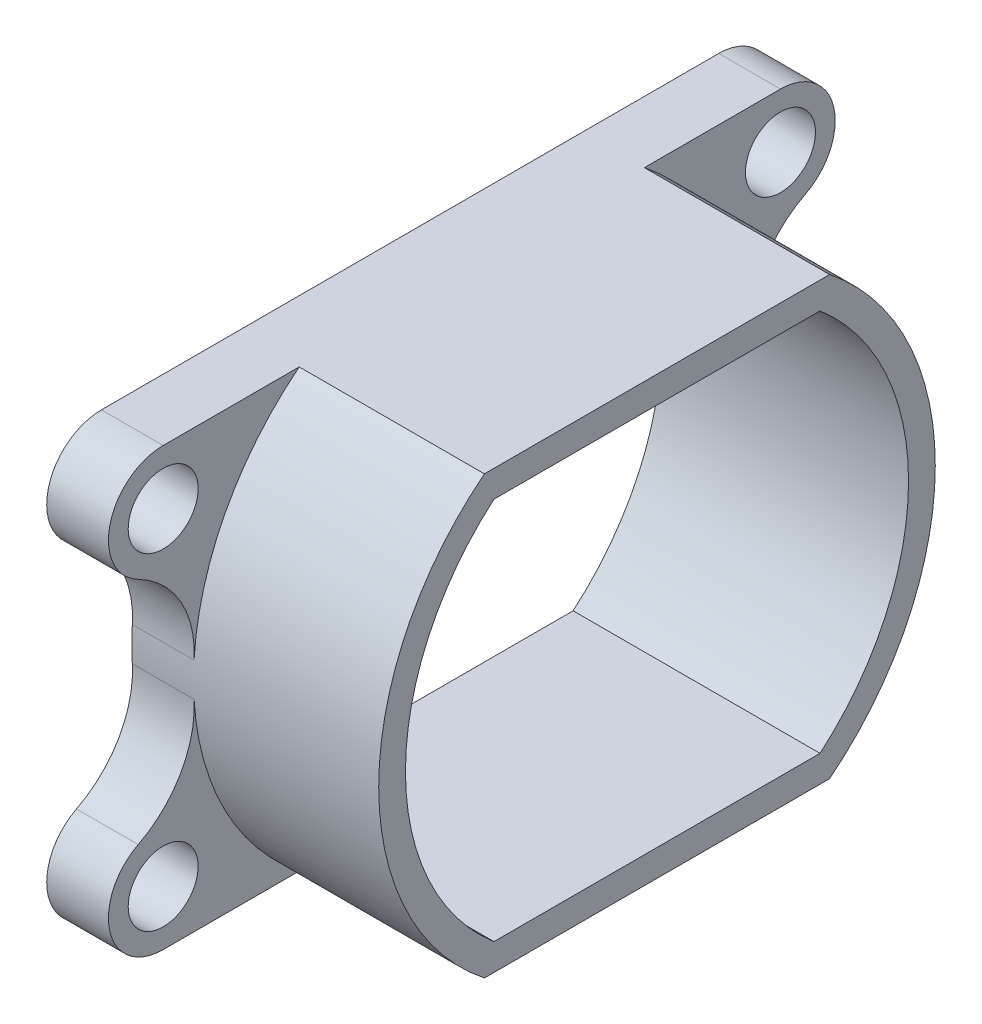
ISO-10303-21;
HEADER;
FILE_DESCRIPTION(('STEP AP214'),'2;1');
FILE_NAME('part.step','',(''),(''),'','','');
FILE_SCHEMA(('AUTOMOTIVE_DESIGN { 1 0 10303 214 1 1 1 1 }'));
ENDSEC;
DATA;
#1=APPLICATION_CONTEXT('core data for automotive mechanical design processes');
#2=APPLICATION_PROTOCOL_DEFINITION('international standard','automotive_design',2000,#1);
#3=PRODUCT_CONTEXT('',#1,'mechanical');
#4=PRODUCT('Part','Part','',(#3));
#5=PRODUCT_RELATED_PRODUCT_CATEGORY('part','',(#4));
#6=PRODUCT_DEFINITION_FORMATION('','',#4);
#7=PRODUCT_DEFINITION_CONTEXT('part definition',#1,'design');
#8=PRODUCT_DEFINITION('design','',#6,#7);
#9=PRODUCT_DEFINITION_SHAPE('','',#8);
#10=(LENGTH_UNIT() NAMED_UNIT(*) SI_UNIT(.MILLI.,.METRE.));
#11=(NAMED_UNIT(*) PLANE_ANGLE_UNIT() SI_UNIT($,.RADIAN.));
#12=(NAMED_UNIT(*) SI_UNIT($,.STERADIAN.) SOLID_ANGLE_UNIT());
#13=UNCERTAINTY_MEASURE_WITH_UNIT(LENGTH_MEASURE(1.E-05),#10,'distance_accuracy_value','');
#14=(GEOMETRIC_REPRESENTATION_CONTEXT(3) GLOBAL_UNCERTAINTY_ASSIGNED_CONTEXT((#13)) GLOBAL_UNIT_ASSIGNED_CONTEXT((#10,
#11,#12)) REPRESENTATION_CONTEXT('',''));
#15=CARTESIAN_POINT('',(0.,0.,0.));
#16=DIRECTION('',(0.,0.,1.));
#17=DIRECTION('',(1.,0.,0.));
#18=AXIS2_PLACEMENT_3D('',#15,#16,#17);
#19=CARTESIAN_POINT('',(12.,0.,0.));
#20=DIRECTION('',(-1.,0.,0.));
#21=DIRECTION('',(0.,0.,1.));
#22=AXIS2_PLACEMENT_3D('',#19,#20,#21);
#23=CYLINDRICAL_SURFACE('',#22,13.525);
#24=CARTESIAN_POINT('',(0.,0.,0.));
#25=DIRECTION('',(1.,0.,0.));
#26=DIRECTION('',(0.,0.,-1.));
#27=AXIS2_PLACEMENT_3D('',#24,#25,#26);
#28=CIRCLE('',#27,13.525);
#29=CARTESIAN_POINT('',(0.,0.826066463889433,13.4997495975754));
#30=VERTEX_POINT('',#29);
#31=CARTESIAN_POINT('',(0.,-0.826066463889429,13.4997495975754));
#32=VERTEX_POINT('',#31);
#33=EDGE_CURVE('E344',#30,#32,#28,.T.);
#34=ORIENTED_EDGE('',*,*,#33,.T.);
#35=DIRECTION('',(-1.,0.,0.));
#36=VECTOR('',#35,1.);
#37=CARTESIAN_POINT('',(12.,-0.826066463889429,13.4997495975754));
#38=LINE('',#37,#36);
#39=CARTESIAN_POINT('',(3.,-0.826066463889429,13.4997495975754));
#40=VERTEX_POINT('',#39);
#41=EDGE_CURVE('E407',#32,#40,#38,.F.);
#42=ORIENTED_EDGE('',*,*,#41,.T.);
#43=CARTESIAN_POINT('',(3.,0.,0.));
#44=DIRECTION('',(-1.,0.,0.));
#45=DIRECTION('',(0.,0.,1.));
#46=AXIS2_PLACEMENT_3D('',#43,#44,#45);
#47=CIRCLE('',#46,13.525);
#48=CARTESIAN_POINT('',(3.,-10.61,8.38770081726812));
#49=VERTEX_POINT('',#48);
#50=EDGE_CURVE('E235',#49,#40,#47,.T.);
#51=ORIENTED_EDGE('',*,*,#50,.F.);
#52=DIRECTION('',(-1.,0.,0.));
#53=VECTOR('',#52,1.);
#54=CARTESIAN_POINT('',(12.,-10.61,8.38770081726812));
#55=LINE('',#54,#53);
#56=CARTESIAN_POINT('',(12.,-10.61,8.38770081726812));
#57=VERTEX_POINT('',#56);
#58=EDGE_CURVE('E380',#57,#49,#55,.T.);
#59=ORIENTED_EDGE('',*,*,#58,.F.);
#60=CARTESIAN_POINT('',(12.,0.,0.));
#61=DIRECTION('',(1.,0.,0.));
#62=DIRECTION('',(0.,0.,-1.));
#63=AXIS2_PLACEMENT_3D('',#60,#61,#62);
#64=CIRCLE('',#63,13.525);
#65=CARTESIAN_POINT('',(12.,10.61,8.38770081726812));
#66=VERTEX_POINT('',#65);
#67=EDGE_CURVE('E345',#66,#57,#64,.T.);
#68=ORIENTED_EDGE('',*,*,#67,.F.);
#69=DIRECTION('',(-1.,0.,0.));
#70=VECTOR('',#69,1.);
#71=CARTESIAN_POINT('',(12.,10.61,8.38770081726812));
#72=LINE('',#71,#70);
#73=CARTESIAN_POINT('',(3.,10.61,8.38770081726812));
#74=VERTEX_POINT('',#73);
#75=EDGE_CURVE('E358',#66,#74,#72,.T.);
#76=ORIENTED_EDGE('',*,*,#75,.T.);
#77=CARTESIAN_POINT('',(3.,0.,0.));
#78=DIRECTION('',(-1.,0.,0.));
#79=DIRECTION('',(0.,0.,1.));
#80=AXIS2_PLACEMENT_3D('',#77,#78,#79);
#81=CIRCLE('',#80,13.525);
#82=CARTESIAN_POINT('',(3.,0.826066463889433,13.4997495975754));
#83=VERTEX_POINT('',#82);
#84=EDGE_CURVE('E192',#83,#74,#81,.T.);
#85=ORIENTED_EDGE('',*,*,#84,.F.);
#86=DIRECTION('',(-1.,0.,0.));
#87=VECTOR('',#86,1.);
#88=CARTESIAN_POINT('',(12.,0.826066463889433,13.4997495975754));
#89=LINE('',#88,#87);
#90=EDGE_CURVE('E403',#83,#30,#89,.T.);
#91=ORIENTED_EDGE('',*,*,#90,.T.);
#92=EDGE_LOOP('',(#34,#42,#51,#59,#68,#76,#85,#91));
#93=FACE_BOUND('',#92,.T.);
#94=ADVANCED_FACE('F47',(#93),#23,.T.);
#95=CARTESIAN_POINT('',(12.,0.,0.));
#96=DIRECTION('',(-1.,0.,0.));
#97=DIRECTION('',(0.,0.,1.));
#98=AXIS2_PLACEMENT_3D('',#95,#96,#97);
#99=CYLINDRICAL_SURFACE('',#98,13.525);
#100=CARTESIAN_POINT('',(3.,0.,0.));
#101=DIRECTION('',(-1.,0.,0.));
#102=DIRECTION('',(0.,0.,1.));
#103=AXIS2_PLACEMENT_3D('',#100,#101,#102);
#104=CIRCLE('',#103,13.525);
#105=CARTESIAN_POINT('',(3.,-0.826066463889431,-13.4997495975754));
#106=VERTEX_POINT('',#105);
#107=CARTESIAN_POINT('',(3.,-10.61,-8.38770081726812));
#108=VERTEX_POINT('',#107);
#109=EDGE_CURVE('E257',#106,#108,#104,.T.);
#110=ORIENTED_EDGE('',*,*,#109,.F.);
#111=DIRECTION('',(-1.,0.,0.));
#112=VECTOR('',#111,1.);
#113=CARTESIAN_POINT('',(12.,-0.826066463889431,-13.4997495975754));
#114=LINE('',#113,#112);
#115=CARTESIAN_POINT('',(0.,-0.826066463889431,-13.4997495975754));
#116=VERTEX_POINT('',#115);
#117=EDGE_CURVE('E388',#106,#116,#114,.T.);
#118=ORIENTED_EDGE('',*,*,#117,.T.);
#119=CARTESIAN_POINT('',(0.,0.,0.));
#120=DIRECTION('',(1.,0.,0.));
#121=DIRECTION('',(0.,0.,-1.));
#122=AXIS2_PLACEMENT_3D('',#119,#120,#121);
#123=CIRCLE('',#122,13.525);
#124=CARTESIAN_POINT('',(0.,0.826066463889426,-13.4997495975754));
#125=VERTEX_POINT('',#124);
#126=EDGE_CURVE('E365',#116,#125,#123,.T.);
#127=ORIENTED_EDGE('',*,*,#126,.T.);
#128=DIRECTION('',(-1.,0.,0.));
#129=VECTOR('',#128,1.);
#130=CARTESIAN_POINT('',(12.,0.826066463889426,-13.4997495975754));
#131=LINE('',#130,#129);
#132=CARTESIAN_POINT('',(3.,0.826066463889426,-13.4997495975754));
#133=VERTEX_POINT('',#132);
#134=EDGE_CURVE('E384',#125,#133,#131,.F.);
#135=ORIENTED_EDGE('',*,*,#134,.T.);
#136=CARTESIAN_POINT('',(3.,0.,0.));
#137=DIRECTION('',(-1.,0.,0.));
#138=DIRECTION('',(0.,0.,1.));
#139=AXIS2_PLACEMENT_3D('',#136,#137,#138);
#140=CIRCLE('',#139,13.525);
#141=CARTESIAN_POINT('',(3.,10.61,-8.38770081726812));
#142=VERTEX_POINT('',#141);
#143=EDGE_CURVE('E289',#142,#133,#140,.T.);
#144=ORIENTED_EDGE('',*,*,#143,.F.);
#145=DIRECTION('',(-1.,0.,0.));
#146=VECTOR('',#145,1.);
#147=CARTESIAN_POINT('',(12.,10.61,-8.38770081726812));
#148=LINE('',#147,#146);
#149=CARTESIAN_POINT('',(12.,10.61,-8.38770081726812));
#150=VERTEX_POINT('',#149);
#151=EDGE_CURVE('E373',#150,#142,#148,.T.);
#152=ORIENTED_EDGE('',*,*,#151,.F.);
#153=CARTESIAN_POINT('',(12.,0.,0.));
#154=DIRECTION('',(1.,0.,0.));
#155=DIRECTION('',(0.,0.,-1.));
#156=AXIS2_PLACEMENT_3D('',#153,#154,#155);
#157=CIRCLE('',#156,13.525);
#158=CARTESIAN_POINT('',(12.,-10.61,-8.38770081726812));
#159=VERTEX_POINT('',#158);
#160=EDGE_CURVE('E352',#159,#150,#157,.T.);
#161=ORIENTED_EDGE('',*,*,#160,.F.);
#162=DIRECTION('',(-1.,0.,0.));
#163=VECTOR('',#162,1.);
#164=CARTESIAN_POINT('',(12.,-10.61,-8.38770081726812));
#165=LINE('',#164,#163);
#166=EDGE_CURVE('E377',#159,#108,#165,.T.);
#167=ORIENTED_EDGE('',*,*,#166,.T.);
#168=EDGE_LOOP('',(#110,#118,#127,#135,#144,#152,#161,#167));
#169=FACE_BOUND('',#168,.T.);
#170=ADVANCED_FACE('F455',(#169),#99,.T.);
#171=CARTESIAN_POINT('',(12.,0.,0.));
#172=DIRECTION('',(1.,0.,0.));
#173=DIRECTION('',(0.,0.,-1.));
#174=AXIS2_PLACEMENT_3D('',#171,#172,#173);
#175=PLANE('',#174);
#176=ORIENTED_EDGE('',*,*,#67,.T.);
#177=DIRECTION('',(0.,0.,-1.));
#178=VECTOR('',#177,1.);
#179=CARTESIAN_POINT('',(12.,-10.61,8.38770081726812));
#180=LINE('',#179,#178);
#181=EDGE_CURVE('E349',#57,#159,#180,.T.);
#182=ORIENTED_EDGE('',*,*,#181,.T.);
#183=ORIENTED_EDGE('',*,*,#160,.T.);
#184=DIRECTION('',(0.,0.,1.));
#185=VECTOR('',#184,1.);
#186=CARTESIAN_POINT('',(12.,10.61,8.38770081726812));
#187=LINE('',#186,#185);
#188=EDGE_CURVE('E355',#150,#66,#187,.T.);
#189=ORIENTED_EDGE('',*,*,#188,.T.);
#190=EDGE_LOOP('',(#176,#182,#183,#189));
#191=FACE_BOUND('',#190,.T.);
#192=DIRECTION('',(0.,0.,-1.));
#193=VECTOR('',#192,1.);
#194=CARTESIAN_POINT('',(12.,-9.31,7.9230376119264));
#195=LINE('',#194,#193);
#196=CARTESIAN_POINT('',(12.,-9.31,7.9230376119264));
#197=VERTEX_POINT('',#196);
#198=CARTESIAN_POINT('',(12.,-9.31,-7.9230376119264));
#199=VERTEX_POINT('',#198);
#200=EDGE_CURVE('E305',#197,#199,#195,.T.);
#201=ORIENTED_EDGE('',*,*,#200,.F.);
#202=CARTESIAN_POINT('',(12.,0.,0.));
#203=DIRECTION('',(1.,0.,0.));
#204=DIRECTION('',(0.,0.,-1.));
#205=AXIS2_PLACEMENT_3D('',#202,#203,#204);
#206=CIRCLE('',#205,12.225);
#207=CARTESIAN_POINT('',(12.,9.31,7.9230376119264));
#208=VERTEX_POINT('',#207);
#209=EDGE_CURVE('E302',#208,#197,#206,.T.);
#210=ORIENTED_EDGE('',*,*,#209,.F.);
#211=DIRECTION('',(0.,0.,1.));
#212=VECTOR('',#211,1.);
#213=CARTESIAN_POINT('',(12.,9.31,7.9230376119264));
#214=LINE('',#213,#212);
#215=CARTESIAN_POINT('',(12.,9.31,-7.9230376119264));
#216=VERTEX_POINT('',#215);
#217=EDGE_CURVE('E313',#216,#208,#214,.T.);
#218=ORIENTED_EDGE('',*,*,#217,.F.);
#219=CARTESIAN_POINT('',(12.,0.,0.));
#220=DIRECTION('',(1.,0.,0.));
#221=DIRECTION('',(0.,0.,-1.));
#222=AXIS2_PLACEMENT_3D('',#219,#220,#221);
#223=CIRCLE('',#222,12.225);
#224=EDGE_CURVE('E309',#199,#216,#223,.T.);
#225=ORIENTED_EDGE('',*,*,#224,.F.);
#226=EDGE_LOOP('',(#201,#210,#218,#225));
#227=FACE_BOUND('',#226,.T.);
#228=ADVANCED_FACE('F461',(#191,#227),#175,.T.);
#229=CARTESIAN_POINT('',(0.,0.,0.));
#230=DIRECTION('',(1.,0.,0.));
#231=DIRECTION('',(0.,0.,-1.));
#232=AXIS2_PLACEMENT_3D('',#229,#230,#231);
#233=PLANE('',#232);
#234=ORIENTED_EDGE('',*,*,#33,.F.);
#235=CARTESIAN_POINT('',(0.,1.1314514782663,18.4904148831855));
#236=DIRECTION('',(1.,0.,0.));
#237=DIRECTION('',(0.,0.,-1.));
#238=AXIS2_PLACEMENT_3D('',#235,#236,#237);
#239=CIRCLE('',#238,5.);
#240=CARTESIAN_POINT('',(0.,5.58220116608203,16.2120761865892));
#241=VERTEX_POINT('',#240);
#242=EDGE_CURVE('E56',#30,#241,#239,.T.);
#243=ORIENTED_EDGE('',*,*,#242,.T.);
#244=CARTESIAN_POINT('',(0.,7.95,15.));
#245=DIRECTION('',(-1.,0.,0.));
#246=DIRECTION('',(0.,0.,1.));
#247=AXIS2_PLACEMENT_3D('',#244,#245,#246);
#248=CIRCLE('',#247,2.66);
#249=CARTESIAN_POINT('',(0.,10.61,15.));
#250=VERTEX_POINT('',#249);
#251=EDGE_CURVE('E212',#250,#241,#248,.F.);
#252=ORIENTED_EDGE('',*,*,#251,.F.);
#253=DIRECTION('',(0.,0.,1.));
#254=VECTOR('',#253,1.);
#255=CARTESIAN_POINT('',(0.,10.61,8.38770081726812));
#256=LINE('',#255,#254);
#257=CARTESIAN_POINT('',(0.,10.61,-15.));
#258=VERTEX_POINT('',#257);
#259=EDGE_CURVE('E201',#258,#250,#256,.T.);
#260=ORIENTED_EDGE('',*,*,#259,.F.);
#261=CARTESIAN_POINT('',(0.,7.94999999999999,-15.));
#262=DIRECTION('',(-1.,0.,0.));
#263=DIRECTION('',(0.,0.,1.));
#264=AXIS2_PLACEMENT_3D('',#261,#262,#263);
#265=CIRCLE('',#264,2.66);
#266=CARTESIAN_POINT('',(0.,5.58220116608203,-16.2120761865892));
#267=VERTEX_POINT('',#266);
#268=EDGE_CURVE('E281',#258,#267,#265,.T.);
#269=ORIENTED_EDGE('',*,*,#268,.T.);
#270=CARTESIAN_POINT('',(0.,1.13145147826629,-18.4904148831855));
#271=DIRECTION('',(1.,0.,0.));
#272=DIRECTION('',(0.,0.,-1.));
#273=AXIS2_PLACEMENT_3D('',#270,#271,#272);
#274=CIRCLE('',#273,5.);
#275=EDGE_CURVE('E420',#267,#125,#274,.T.);
#276=ORIENTED_EDGE('',*,*,#275,.T.);
#277=ORIENTED_EDGE('',*,*,#126,.F.);
#278=CARTESIAN_POINT('',(0.,-1.1314514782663,-18.4904148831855));
#279=DIRECTION('',(1.,0.,0.));
#280=DIRECTION('',(0.,0.,-1.));
#281=AXIS2_PLACEMENT_3D('',#278,#279,#280);
#282=CIRCLE('',#281,5.);
#283=CARTESIAN_POINT('',(0.,-5.58220116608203,-16.2120761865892));
#284=VERTEX_POINT('',#283);
#285=EDGE_CURVE('E413',#116,#284,#282,.T.);
#286=ORIENTED_EDGE('',*,*,#285,.T.);
#287=CARTESIAN_POINT('',(0.,-7.95,-15.));
#288=DIRECTION('',(-1.,0.,0.));
#289=DIRECTION('',(0.,0.,1.));
#290=AXIS2_PLACEMENT_3D('',#287,#288,#289);
#291=CIRCLE('',#290,2.66);
#292=CARTESIAN_POINT('',(0.,-10.61,-15.));
#293=VERTEX_POINT('',#292);
#294=EDGE_CURVE('E248',#293,#284,#291,.F.);
#295=ORIENTED_EDGE('',*,*,#294,.F.);
#296=DIRECTION('',(0.,0.,-1.));
#297=VECTOR('',#296,1.);
#298=CARTESIAN_POINT('',(0.,-10.61,8.38770081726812));
#299=LINE('',#298,#297);
#300=CARTESIAN_POINT('',(0.,-10.61,15.));
#301=VERTEX_POINT('',#300);
#302=EDGE_CURVE('E362',#301,#293,#299,.T.);
#303=ORIENTED_EDGE('',*,*,#302,.F.);
#304=CARTESIAN_POINT('',(0.,-7.95,15.));
#305=DIRECTION('',(-1.,0.,0.));
#306=DIRECTION('',(0.,0.,1.));
#307=AXIS2_PLACEMENT_3D('',#304,#305,#306);
#308=CIRCLE('',#307,2.66);
#309=CARTESIAN_POINT('',(0.,-5.58220116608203,16.2120761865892));
#310=VERTEX_POINT('',#309);
#311=EDGE_CURVE('E227',#301,#310,#308,.T.);
#312=ORIENTED_EDGE('',*,*,#311,.T.);
#313=CARTESIAN_POINT('',(0.,-1.1314514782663,18.4904148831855));
#314=DIRECTION('',(1.,0.,0.));
#315=DIRECTION('',(0.,0.,-1.));
#316=AXIS2_PLACEMENT_3D('',#313,#314,#315);
#317=CIRCLE('',#316,5.);
#318=EDGE_CURVE('E426',#310,#32,#317,.T.);
#319=ORIENTED_EDGE('',*,*,#318,.T.);
#320=EDGE_LOOP('',(#234,#243,#252,#260,#269,#276,#277,#286,#295,#303,#312,#319));
#321=FACE_BOUND('',#320,.T.);
#322=CARTESIAN_POINT('',(0.,0.,0.));
#323=DIRECTION('',(1.,0.,0.));
#324=DIRECTION('',(0.,0.,-1.));
#325=AXIS2_PLACEMENT_3D('',#322,#323,#324);
#326=CIRCLE('',#325,12.225);
#327=CARTESIAN_POINT('',(0.,9.31,7.9230376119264));
#328=VERTEX_POINT('',#327);
#329=CARTESIAN_POINT('',(0.,-9.31,7.9230376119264));
#330=VERTEX_POINT('',#329);
#331=EDGE_CURVE('E301',#328,#330,#326,.T.);
#332=ORIENTED_EDGE('',*,*,#331,.T.);
#333=DIRECTION('',(0.,0.,-1.));
#334=VECTOR('',#333,1.);
#335=CARTESIAN_POINT('',(0.,-9.31,7.9230376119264));
#336=LINE('',#335,#334);
#337=CARTESIAN_POINT('',(0.,-9.31,-7.9230376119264));
#338=VERTEX_POINT('',#337);
#339=EDGE_CURVE('E320',#330,#338,#336,.T.);
#340=ORIENTED_EDGE('',*,*,#339,.T.);
#341=CARTESIAN_POINT('',(0.,0.,0.));
#342=DIRECTION('',(1.,0.,0.));
#343=DIRECTION('',(0.,0.,-1.));
#344=AXIS2_PLACEMENT_3D('',#341,#342,#343);
#345=CIRCLE('',#344,12.225);
#346=CARTESIAN_POINT('',(0.,9.31,-7.9230376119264));
#347=VERTEX_POINT('',#346);
#348=EDGE_CURVE('E324',#338,#347,#345,.T.);
#349=ORIENTED_EDGE('',*,*,#348,.T.);
#350=DIRECTION('',(0.,0.,1.));
#351=VECTOR('',#350,1.);
#352=CARTESIAN_POINT('',(0.,9.31,7.9230376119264));
#353=LINE('',#352,#351);
#354=EDGE_CURVE('E306',#347,#328,#353,.T.);
#355=ORIENTED_EDGE('',*,*,#354,.T.);
#356=EDGE_LOOP('',(#332,#340,#349,#355));
#357=FACE_BOUND('',#356,.T.);
#358=CARTESIAN_POINT('',(0.,7.94999999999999,-15.));
#359=DIRECTION('',(-1.,0.,0.));
#360=DIRECTION('',(0.,0.,1.));
#361=AXIS2_PLACEMENT_3D('',#358,#359,#360);
#362=CIRCLE('',#361,1.7);
#363=CARTESIAN_POINT('',(0.,7.94999999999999,-13.3));
#364=VERTEX_POINT('',#363);
#365=EDGE_CURVE('E275',#364,#364,#362,.F.);
#366=ORIENTED_EDGE('',*,*,#365,.T.);
#367=EDGE_LOOP('',(#366));
#368=FACE_BOUND('',#367,.T.);
#369=CARTESIAN_POINT('',(0.,-7.95,-15.));
#370=DIRECTION('',(-1.,0.,0.));
#371=DIRECTION('',(0.,0.,1.));
#372=AXIS2_PLACEMENT_3D('',#369,#370,#371);
#373=CIRCLE('',#372,1.7);
#374=CARTESIAN_POINT('',(0.,-7.95,-13.3));
#375=VERTEX_POINT('',#374);
#376=EDGE_CURVE('E254',#375,#375,#373,.T.);
#377=ORIENTED_EDGE('',*,*,#376,.F.);
#378=EDGE_LOOP('',(#377));
#379=FACE_BOUND('',#378,.T.);
#380=CARTESIAN_POINT('',(0.,-7.95,15.));
#381=DIRECTION('',(-1.,0.,0.));
#382=DIRECTION('',(0.,0.,1.));
#383=AXIS2_PLACEMENT_3D('',#380,#381,#382);
#384=CIRCLE('',#383,1.7);
#385=CARTESIAN_POINT('',(0.,-7.95,16.7));
#386=VERTEX_POINT('',#385);
#387=EDGE_CURVE('E203',#386,#386,#384,.F.);
#388=ORIENTED_EDGE('',*,*,#387,.T.);
#389=EDGE_LOOP('',(#388));
#390=FACE_BOUND('',#389,.T.);
#391=CARTESIAN_POINT('',(0.,7.95,15.));
#392=DIRECTION('',(-1.,0.,0.));
#393=DIRECTION('',(0.,0.,1.));
#394=AXIS2_PLACEMENT_3D('',#391,#392,#393);
#395=CIRCLE('',#394,1.7);
#396=CARTESIAN_POINT('',(0.,7.95,16.7));
#397=VERTEX_POINT('',#396);
#398=EDGE_CURVE('E208',#397,#397,#395,.T.);
#399=ORIENTED_EDGE('',*,*,#398,.F.);
#400=EDGE_LOOP('',(#399));
#401=FACE_BOUND('',#400,.T.);
#402=ADVANCED_FACE('F444',(#321,#357,#368,#379,#390,#401),#233,.F.);
#403=CARTESIAN_POINT('',(12.,-10.61,8.38770081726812));
#404=DIRECTION('',(0.,1.,0.));
#405=DIRECTION('',(0.,0.,1.));
#406=AXIS2_PLACEMENT_3D('',#403,#404,#405);
#407=PLANE('',#406);
#408=ORIENTED_EDGE('',*,*,#302,.T.);
#409=DIRECTION('',(-1.,0.,0.));
#410=VECTOR('',#409,1.);
#411=CARTESIAN_POINT('',(3.,-10.61,-15.));
#412=LINE('',#411,#410);
#413=CARTESIAN_POINT('',(3.,-10.61,-15.));
#414=VERTEX_POINT('',#413);
#415=EDGE_CURVE('E265',#414,#293,#412,.T.);
#416=ORIENTED_EDGE('',*,*,#415,.F.);
#417=DIRECTION('',(0.,0.,-1.));
#418=VECTOR('',#417,1.);
#419=CARTESIAN_POINT('',(3.,-10.61,0.));
#420=LINE('',#419,#418);
#421=EDGE_CURVE('E253',#108,#414,#420,.T.);
#422=ORIENTED_EDGE('',*,*,#421,.F.);
#423=ORIENTED_EDGE('',*,*,#166,.F.);
#424=ORIENTED_EDGE('',*,*,#181,.F.);
#425=ORIENTED_EDGE('',*,*,#58,.T.);
#426=DIRECTION('',(0.,0.,1.));
#427=VECTOR('',#426,1.);
#428=CARTESIAN_POINT('',(3.,-10.61,0.));
#429=LINE('',#428,#427);
#430=CARTESIAN_POINT('',(3.,-10.61,15.));
#431=VERTEX_POINT('',#430);
#432=EDGE_CURVE('E226',#49,#431,#429,.T.);
#433=ORIENTED_EDGE('',*,*,#432,.T.);
#434=DIRECTION('',(-1.,0.,0.));
#435=VECTOR('',#434,1.);
#436=CARTESIAN_POINT('',(3.,-10.61,15.));
#437=LINE('',#436,#435);
#438=EDGE_CURVE('E238',#431,#301,#437,.T.);
#439=ORIENTED_EDGE('',*,*,#438,.T.);
#440=EDGE_LOOP('',(#408,#416,#422,#423,#424,#425,#433,#439));
#441=FACE_BOUND('',#440,.T.);
#442=ADVANCED_FACE('F466',(#441),#407,.F.);
#443=CARTESIAN_POINT('',(12.,10.61,8.38770081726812));
#444=DIRECTION('',(0.,-1.,0.));
#445=DIRECTION('',(0.,0.,-1.));
#446=AXIS2_PLACEMENT_3D('',#443,#444,#445);
#447=PLANE('',#446);
#448=ORIENTED_EDGE('',*,*,#259,.T.);
#449=DIRECTION('',(-1.,0.,0.));
#450=VECTOR('',#449,1.);
#451=CARTESIAN_POINT('',(3.,10.61,15.));
#452=LINE('',#451,#450);
#453=CARTESIAN_POINT('',(3.,10.61,15.));
#454=VERTEX_POINT('',#453);
#455=EDGE_CURVE('E198',#454,#250,#452,.T.);
#456=ORIENTED_EDGE('',*,*,#455,.F.);
#457=DIRECTION('',(0.,0.,1.));
#458=VECTOR('',#457,1.);
#459=CARTESIAN_POINT('',(3.,10.61,0.));
#460=LINE('',#459,#458);
#461=EDGE_CURVE('E186',#74,#454,#460,.T.);
#462=ORIENTED_EDGE('',*,*,#461,.F.);
#463=ORIENTED_EDGE('',*,*,#75,.F.);
#464=ORIENTED_EDGE('',*,*,#188,.F.);
#465=ORIENTED_EDGE('',*,*,#151,.T.);
#466=DIRECTION('',(0.,0.,-1.));
#467=VECTOR('',#466,1.);
#468=CARTESIAN_POINT('',(3.,10.61,0.));
#469=LINE('',#468,#467);
#470=CARTESIAN_POINT('',(3.,10.61,-15.));
#471=VERTEX_POINT('',#470);
#472=EDGE_CURVE('E280',#142,#471,#469,.T.);
#473=ORIENTED_EDGE('',*,*,#472,.T.);
#474=DIRECTION('',(-1.,0.,0.));
#475=VECTOR('',#474,1.);
#476=CARTESIAN_POINT('',(3.,10.61,-15.));
#477=LINE('',#476,#475);
#478=EDGE_CURVE('E292',#471,#258,#477,.T.);
#479=ORIENTED_EDGE('',*,*,#478,.T.);
#480=EDGE_LOOP('',(#448,#456,#462,#463,#464,#465,#473,#479));
#481=FACE_BOUND('',#480,.T.);
#482=ADVANCED_FACE('F199',(#481),#447,.F.);
#483=CARTESIAN_POINT('',(12.,0.,0.));
#484=DIRECTION('',(-1.,0.,0.));
#485=DIRECTION('',(0.,0.,1.));
#486=AXIS2_PLACEMENT_3D('',#483,#484,#485);
#487=CYLINDRICAL_SURFACE('',#486,12.225);
#488=ORIENTED_EDGE('',*,*,#331,.F.);
#489=DIRECTION('',(-1.,0.,0.));
#490=VECTOR('',#489,1.);
#491=CARTESIAN_POINT('',(12.,9.31,7.9230376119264));
#492=LINE('',#491,#490);
#493=EDGE_CURVE('E316',#208,#328,#492,.T.);
#494=ORIENTED_EDGE('',*,*,#493,.F.);
#495=ORIENTED_EDGE('',*,*,#209,.T.);
#496=DIRECTION('',(-1.,0.,0.));
#497=VECTOR('',#496,1.);
#498=CARTESIAN_POINT('',(12.,-9.31,7.9230376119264));
#499=LINE('',#498,#497);
#500=EDGE_CURVE('E340',#197,#330,#499,.T.);
#501=ORIENTED_EDGE('',*,*,#500,.T.);
#502=EDGE_LOOP('',(#488,#494,#495,#501));
#503=FACE_BOUND('',#502,.T.);
#504=ADVANCED_FACE('F523',(#503),#487,.F.);
#505=CARTESIAN_POINT('',(12.,-9.31,7.9230376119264));
#506=DIRECTION('',(0.,1.,0.));
#507=DIRECTION('',(0.,0.,1.));
#508=AXIS2_PLACEMENT_3D('',#505,#506,#507);
#509=PLANE('',#508);
#510=ORIENTED_EDGE('',*,*,#339,.F.);
#511=ORIENTED_EDGE('',*,*,#500,.F.);
#512=ORIENTED_EDGE('',*,*,#200,.T.);
#513=DIRECTION('',(-1.,0.,0.));
#514=VECTOR('',#513,1.);
#515=CARTESIAN_POINT('',(12.,-9.31,-7.9230376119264));
#516=LINE('',#515,#514);
#517=EDGE_CURVE('E337',#199,#338,#516,.T.);
#518=ORIENTED_EDGE('',*,*,#517,.T.);
#519=EDGE_LOOP('',(#510,#511,#512,#518));
#520=FACE_BOUND('',#519,.T.);
#521=ADVANCED_FACE('F516',(#520),#509,.T.);
#522=CARTESIAN_POINT('',(12.,0.,0.));
#523=DIRECTION('',(-1.,0.,0.));
#524=DIRECTION('',(0.,0.,1.));
#525=AXIS2_PLACEMENT_3D('',#522,#523,#524);
#526=CYLINDRICAL_SURFACE('',#525,12.225);
#527=ORIENTED_EDGE('',*,*,#348,.F.);
#528=ORIENTED_EDGE('',*,*,#517,.F.);
#529=ORIENTED_EDGE('',*,*,#224,.T.);
#530=DIRECTION('',(-1.,0.,0.));
#531=VECTOR('',#530,1.);
#532=CARTESIAN_POINT('',(12.,9.31,-7.9230376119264));
#533=LINE('',#532,#531);
#534=EDGE_CURVE('E334',#216,#347,#533,.T.);
#535=ORIENTED_EDGE('',*,*,#534,.T.);
#536=EDGE_LOOP('',(#527,#528,#529,#535));
#537=FACE_BOUND('',#536,.T.);
#538=ADVANCED_FACE('F519',(#537),#526,.F.);
#539=CARTESIAN_POINT('',(12.,9.31,7.9230376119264));
#540=DIRECTION('',(0.,-1.,0.));
#541=DIRECTION('',(0.,0.,-1.));
#542=AXIS2_PLACEMENT_3D('',#539,#540,#541);
#543=PLANE('',#542);
#544=ORIENTED_EDGE('',*,*,#354,.F.);
#545=ORIENTED_EDGE('',*,*,#534,.F.);
#546=ORIENTED_EDGE('',*,*,#217,.T.);
#547=ORIENTED_EDGE('',*,*,#493,.T.);
#548=EDGE_LOOP('',(#544,#545,#546,#547));
#549=FACE_BOUND('',#548,.T.);
#550=ADVANCED_FACE('F526',(#549),#543,.T.);
#551=CARTESIAN_POINT('',(3.,7.94999999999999,-15.));
#552=DIRECTION('',(-1.,0.,0.));
#553=DIRECTION('',(0.,0.,1.));
#554=AXIS2_PLACEMENT_3D('',#551,#552,#553);
#555=CYLINDRICAL_SURFACE('',#554,1.7);
#556=CARTESIAN_POINT('',(3.,7.94999999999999,-15.));
#557=DIRECTION('',(-1.,0.,0.));
#558=DIRECTION('',(0.,0.,1.));
#559=AXIS2_PLACEMENT_3D('',#556,#557,#558);
#560=CIRCLE('',#559,1.7);
#561=CARTESIAN_POINT('',(3.,7.94999999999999,-13.3));
#562=VERTEX_POINT('',#561);
#563=EDGE_CURVE('E276',#562,#562,#560,.F.);
#564=ORIENTED_EDGE('',*,*,#563,.T.);
#565=EDGE_LOOP('',(#564));
#566=FACE_BOUND('',#565,.T.);
#567=ORIENTED_EDGE('',*,*,#365,.F.);
#568=EDGE_LOOP('',(#567));
#569=FACE_BOUND('',#568,.T.);
#570=ADVANCED_FACE('F528',(#566,#569),#555,.F.);
#571=CARTESIAN_POINT('',(3.,7.94999999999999,-15.));
#572=DIRECTION('',(-1.,0.,0.));
#573=DIRECTION('',(0.,0.,1.));
#574=AXIS2_PLACEMENT_3D('',#571,#572,#573);
#575=CYLINDRICAL_SURFACE('',#574,2.66);
#576=CARTESIAN_POINT('',(3.,7.94999999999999,-15.));
#577=DIRECTION('',(-1.,0.,0.));
#578=DIRECTION('',(0.,0.,1.));
#579=AXIS2_PLACEMENT_3D('',#576,#577,#578);
#580=CIRCLE('',#579,2.66);
#581=CARTESIAN_POINT('',(3.,5.58220116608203,-16.2120761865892));
#582=VERTEX_POINT('',#581);
#583=EDGE_CURVE('E285',#471,#582,#580,.T.);
#584=ORIENTED_EDGE('',*,*,#583,.T.);
#585=DIRECTION('',(-1.,0.,0.));
#586=VECTOR('',#585,1.);
#587=CARTESIAN_POINT('',(3.,5.58220116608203,-16.2120761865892));
#588=LINE('',#587,#586);
#589=EDGE_CURVE('E395',#582,#267,#588,.T.);
#590=ORIENTED_EDGE('',*,*,#589,.T.);
#591=ORIENTED_EDGE('',*,*,#268,.F.);
#592=ORIENTED_EDGE('',*,*,#478,.F.);
#593=EDGE_LOOP('',(#584,#590,#591,#592));
#594=FACE_BOUND('',#593,.T.);
#595=ADVANCED_FACE('F483',(#594),#575,.T.);
#596=CARTESIAN_POINT('',(3.,0.,0.));
#597=DIRECTION('',(-1.,0.,0.));
#598=DIRECTION('',(0.,0.,1.));
#599=AXIS2_PLACEMENT_3D('',#596,#597,#598);
#600=PLANE('',#599);
#601=ORIENTED_EDGE('',*,*,#563,.F.);
#602=EDGE_LOOP('',(#601));
#603=FACE_BOUND('',#602,.T.);
#604=ORIENTED_EDGE('',*,*,#472,.F.);
#605=ORIENTED_EDGE('',*,*,#143,.T.);
#606=CARTESIAN_POINT('',(3.,1.13145147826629,-18.4904148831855));
#607=DIRECTION('',(-1.,0.,0.));
#608=DIRECTION('',(0.,0.,1.));
#609=AXIS2_PLACEMENT_3D('',#606,#607,#608);
#610=CIRCLE('',#609,5.);
#611=EDGE_CURVE('E423',#133,#582,#610,.T.);
#612=ORIENTED_EDGE('',*,*,#611,.T.);
#613=ORIENTED_EDGE('',*,*,#583,.F.);
#614=EDGE_LOOP('',(#604,#605,#612,#613));
#615=FACE_BOUND('',#614,.T.);
#616=ADVANCED_FACE('F480',(#603,#615),#600,.F.);
#617=CARTESIAN_POINT('',(3.,-7.95,-15.));
#618=DIRECTION('',(-1.,0.,0.));
#619=DIRECTION('',(0.,0.,1.));
#620=AXIS2_PLACEMENT_3D('',#617,#618,#619);
#621=CYLINDRICAL_SURFACE('',#620,2.66);
#622=ORIENTED_EDGE('',*,*,#294,.T.);
#623=DIRECTION('',(-1.,0.,0.));
#624=VECTOR('',#623,1.);
#625=CARTESIAN_POINT('',(3.,-5.58220116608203,-16.2120761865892));
#626=LINE('',#625,#624);
#627=CARTESIAN_POINT('',(3.,-5.58220116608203,-16.2120761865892));
#628=VERTEX_POINT('',#627);
#629=EDGE_CURVE('E392',#284,#628,#626,.F.);
#630=ORIENTED_EDGE('',*,*,#629,.T.);
#631=CARTESIAN_POINT('',(3.,-7.95,-15.));
#632=DIRECTION('',(-1.,0.,0.));
#633=DIRECTION('',(0.,0.,1.));
#634=AXIS2_PLACEMENT_3D('',#631,#632,#633);
#635=CIRCLE('',#634,2.66);
#636=EDGE_CURVE('E249',#414,#628,#635,.F.);
#637=ORIENTED_EDGE('',*,*,#636,.F.);
#638=ORIENTED_EDGE('',*,*,#415,.T.);
#639=EDGE_LOOP('',(#622,#630,#637,#638));
#640=FACE_BOUND('',#639,.T.);
#641=ADVANCED_FACE('F493',(#640),#621,.T.);
#642=CARTESIAN_POINT('',(3.,-7.95,-15.));
#643=DIRECTION('',(-1.,0.,0.));
#644=DIRECTION('',(0.,0.,1.));
#645=AXIS2_PLACEMENT_3D('',#642,#643,#644);
#646=CYLINDRICAL_SURFACE('',#645,1.7);
#647=CARTESIAN_POINT('',(3.,-7.95,-15.));
#648=DIRECTION('',(-1.,0.,0.));
#649=DIRECTION('',(0.,0.,1.));
#650=AXIS2_PLACEMENT_3D('',#647,#648,#649);
#651=CIRCLE('',#650,1.7);
#652=CARTESIAN_POINT('',(3.,-7.95,-13.3));
#653=VERTEX_POINT('',#652);
#654=EDGE_CURVE('E261',#653,#653,#651,.T.);
#655=ORIENTED_EDGE('',*,*,#654,.F.);
#656=EDGE_LOOP('',(#655));
#657=FACE_BOUND('',#656,.T.);
#658=ORIENTED_EDGE('',*,*,#376,.T.);
#659=EDGE_LOOP('',(#658));
#660=FACE_BOUND('',#659,.T.);
#661=ADVANCED_FACE('F597',(#657,#660),#646,.F.);
#662=CARTESIAN_POINT('',(3.,0.,0.));
#663=DIRECTION('',(-1.,0.,0.));
#664=DIRECTION('',(0.,0.,1.));
#665=AXIS2_PLACEMENT_3D('',#662,#663,#664);
#666=PLANE('',#665);
#667=ORIENTED_EDGE('',*,*,#636,.T.);
#668=CARTESIAN_POINT('',(3.,-1.1314514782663,-18.4904148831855));
#669=DIRECTION('',(-1.,0.,0.));
#670=DIRECTION('',(0.,0.,1.));
#671=AXIS2_PLACEMENT_3D('',#668,#669,#670);
#672=CIRCLE('',#671,5.);
#673=EDGE_CURVE('E416',#628,#106,#672,.T.);
#674=ORIENTED_EDGE('',*,*,#673,.T.);
#675=ORIENTED_EDGE('',*,*,#109,.T.);
#676=ORIENTED_EDGE('',*,*,#421,.T.);
#677=EDGE_LOOP('',(#667,#674,#675,#676));
#678=FACE_BOUND('',#677,.T.);
#679=ORIENTED_EDGE('',*,*,#654,.T.);
#680=EDGE_LOOP('',(#679));
#681=FACE_BOUND('',#680,.T.);
#682=ADVANCED_FACE('F498',(#678,#681),#666,.F.);
#683=CARTESIAN_POINT('',(3.,-7.95,15.));
#684=DIRECTION('',(-1.,0.,0.));
#685=DIRECTION('',(0.,0.,1.));
#686=AXIS2_PLACEMENT_3D('',#683,#684,#685);
#687=CYLINDRICAL_SURFACE('',#686,1.7);
#688=CARTESIAN_POINT('',(3.,-7.95,15.));
#689=DIRECTION('',(-1.,0.,0.));
#690=DIRECTION('',(0.,0.,1.));
#691=AXIS2_PLACEMENT_3D('',#688,#689,#690);
#692=CIRCLE('',#691,1.7);
#693=CARTESIAN_POINT('',(3.,-7.95,16.7));
#694=VERTEX_POINT('',#693);
#695=EDGE_CURVE('E222',#694,#694,#692,.F.);
#696=ORIENTED_EDGE('',*,*,#695,.T.);
#697=EDGE_LOOP('',(#696));
#698=FACE_BOUND('',#697,.T.);
#699=ORIENTED_EDGE('',*,*,#387,.F.);
#700=EDGE_LOOP('',(#699));
#701=FACE_BOUND('',#700,.T.);
#702=ADVANCED_FACE('F615',(#698,#701),#687,.F.);
#703=CARTESIAN_POINT('',(3.,-7.95,15.));
#704=DIRECTION('',(-1.,0.,0.));
#705=DIRECTION('',(0.,0.,1.));
#706=AXIS2_PLACEMENT_3D('',#703,#704,#705);
#707=CYLINDRICAL_SURFACE('',#706,2.66);
#708=CARTESIAN_POINT('',(3.,-7.95,15.));
#709=DIRECTION('',(-1.,0.,0.));
#710=DIRECTION('',(0.,0.,1.));
#711=AXIS2_PLACEMENT_3D('',#708,#709,#710);
#712=CIRCLE('',#711,2.66);
#713=CARTESIAN_POINT('',(3.,-5.58220116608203,16.2120761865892));
#714=VERTEX_POINT('',#713);
#715=EDGE_CURVE('E231',#431,#714,#712,.T.);
#716=ORIENTED_EDGE('',*,*,#715,.T.);
#717=DIRECTION('',(-1.,0.,0.));
#718=VECTOR('',#717,1.);
#719=CARTESIAN_POINT('',(3.,-5.58220116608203,16.2120761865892));
#720=LINE('',#719,#718);
#721=EDGE_CURVE('E399',#714,#310,#720,.T.);
#722=ORIENTED_EDGE('',*,*,#721,.T.);
#723=ORIENTED_EDGE('',*,*,#311,.F.);
#724=ORIENTED_EDGE('',*,*,#438,.F.);
#725=EDGE_LOOP('',(#716,#722,#723,#724));
#726=FACE_BOUND('',#725,.T.);
#727=ADVANCED_FACE('F441',(#726),#707,.T.);
#728=CARTESIAN_POINT('',(3.,0.,0.));
#729=DIRECTION('',(-1.,0.,0.));
#730=DIRECTION('',(0.,0.,1.));
#731=AXIS2_PLACEMENT_3D('',#728,#729,#730);
#732=PLANE('',#731);
#733=ORIENTED_EDGE('',*,*,#695,.F.);
#734=EDGE_LOOP('',(#733));
#735=FACE_BOUND('',#734,.T.);
#736=ORIENTED_EDGE('',*,*,#432,.F.);
#737=ORIENTED_EDGE('',*,*,#50,.T.);
#738=CARTESIAN_POINT('',(3.,-1.1314514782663,18.4904148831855));
#739=DIRECTION('',(-1.,0.,0.));
#740=DIRECTION('',(0.,0.,1.));
#741=AXIS2_PLACEMENT_3D('',#738,#739,#740);
#742=CIRCLE('',#741,5.);
#743=EDGE_CURVE('E429',#40,#714,#742,.T.);
#744=ORIENTED_EDGE('',*,*,#743,.T.);
#745=ORIENTED_EDGE('',*,*,#715,.F.);
#746=EDGE_LOOP('',(#736,#737,#744,#745));
#747=FACE_BOUND('',#746,.T.);
#748=ADVANCED_FACE('F435',(#735,#747),#732,.F.);
#749=CARTESIAN_POINT('',(3.,7.95,15.));
#750=DIRECTION('',(-1.,0.,0.));
#751=DIRECTION('',(0.,0.,1.));
#752=AXIS2_PLACEMENT_3D('',#749,#750,#751);
#753=CYLINDRICAL_SURFACE('',#752,2.66);
#754=ORIENTED_EDGE('',*,*,#251,.T.);
#755=DIRECTION('',(-1.,0.,0.));
#756=VECTOR('',#755,1.);
#757=CARTESIAN_POINT('',(3.,5.58220116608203,16.2120761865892));
#758=LINE('',#757,#756);
#759=CARTESIAN_POINT('',(3.,5.58220116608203,16.2120761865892));
#760=VERTEX_POINT('',#759);
#761=EDGE_CURVE('E63',#241,#760,#758,.F.);
#762=ORIENTED_EDGE('',*,*,#761,.T.);
#763=CARTESIAN_POINT('',(3.,7.95,15.));
#764=DIRECTION('',(-1.,0.,0.));
#765=DIRECTION('',(0.,0.,1.));
#766=AXIS2_PLACEMENT_3D('',#763,#764,#765);
#767=CIRCLE('',#766,2.66);
#768=EDGE_CURVE('E190',#454,#760,#767,.F.);
#769=ORIENTED_EDGE('',*,*,#768,.F.);
#770=ORIENTED_EDGE('',*,*,#455,.T.);
#771=EDGE_LOOP('',(#754,#762,#769,#770));
#772=FACE_BOUND('',#771,.T.);
#773=ADVANCED_FACE('F206',(#772),#753,.T.);
#774=CARTESIAN_POINT('',(3.,7.95,15.));
#775=DIRECTION('',(-1.,0.,0.));
#776=DIRECTION('',(0.,0.,1.));
#777=AXIS2_PLACEMENT_3D('',#774,#775,#776);
#778=CYLINDRICAL_SURFACE('',#777,1.7);
#779=CARTESIAN_POINT('',(3.,7.95,15.));
#780=DIRECTION('',(-1.,0.,0.));
#781=DIRECTION('',(0.,0.,1.));
#782=AXIS2_PLACEMENT_3D('',#779,#780,#781);
#783=CIRCLE('',#782,1.7);
#784=CARTESIAN_POINT('',(3.,7.95,16.7));
#785=VERTEX_POINT('',#784);
#786=EDGE_CURVE('E204',#785,#785,#783,.T.);
#787=ORIENTED_EDGE('',*,*,#786,.F.);
#788=EDGE_LOOP('',(#787));
#789=FACE_BOUND('',#788,.T.);
#790=ORIENTED_EDGE('',*,*,#398,.T.);
#791=EDGE_LOOP('',(#790));
#792=FACE_BOUND('',#791,.T.);
#793=ADVANCED_FACE('F649',(#789,#792),#778,.F.);
#794=CARTESIAN_POINT('',(3.,0.,0.));
#795=DIRECTION('',(-1.,0.,0.));
#796=DIRECTION('',(0.,0.,1.));
#797=AXIS2_PLACEMENT_3D('',#794,#795,#796);
#798=PLANE('',#797);
#799=ORIENTED_EDGE('',*,*,#768,.T.);
#800=CARTESIAN_POINT('',(3.,1.1314514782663,18.4904148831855));
#801=DIRECTION('',(-1.,0.,0.));
#802=DIRECTION('',(0.,0.,1.));
#803=AXIS2_PLACEMENT_3D('',#800,#801,#802);
#804=CIRCLE('',#803,5.);
#805=EDGE_CURVE('E11',#760,#83,#804,.T.);
#806=ORIENTED_EDGE('',*,*,#805,.T.);
#807=ORIENTED_EDGE('',*,*,#84,.T.);
#808=ORIENTED_EDGE('',*,*,#461,.T.);
#809=EDGE_LOOP('',(#799,#806,#807,#808));
#810=FACE_BOUND('',#809,.T.);
#811=ORIENTED_EDGE('',*,*,#786,.T.);
#812=EDGE_LOOP('',(#811));
#813=FACE_BOUND('',#812,.T.);
#814=ADVANCED_FACE('F188',(#810,#813),#798,.F.);
#815=CARTESIAN_POINT('',(3.,-1.1314514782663,-18.4904148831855));
#816=DIRECTION('',(1.,0.,0.));
#817=DIRECTION('',(0.,0.,-1.));
#818=AXIS2_PLACEMENT_3D('',#815,#816,#817);
#819=CYLINDRICAL_SURFACE('',#818,5.);
#820=ORIENTED_EDGE('',*,*,#673,.F.);
#821=ORIENTED_EDGE('',*,*,#629,.F.);
#822=ORIENTED_EDGE('',*,*,#285,.F.);
#823=ORIENTED_EDGE('',*,*,#117,.F.);
#824=EDGE_LOOP('',(#820,#821,#822,#823));
#825=FACE_BOUND('',#824,.T.);
#826=ADVANCED_FACE('F467',(#825),#819,.F.);
#827=CARTESIAN_POINT('',(12.,1.13145147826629,-18.4904148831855));
#828=DIRECTION('',(1.,0.,0.));
#829=DIRECTION('',(0.,0.,-1.));
#830=AXIS2_PLACEMENT_3D('',#827,#828,#829);
#831=CYLINDRICAL_SURFACE('',#830,5.);
#832=ORIENTED_EDGE('',*,*,#611,.F.);
#833=ORIENTED_EDGE('',*,*,#134,.F.);
#834=ORIENTED_EDGE('',*,*,#275,.F.);
#835=ORIENTED_EDGE('',*,*,#589,.F.);
#836=EDGE_LOOP('',(#832,#833,#834,#835));
#837=FACE_BOUND('',#836,.T.);
#838=ADVANCED_FACE('F453',(#837),#831,.F.);
#839=CARTESIAN_POINT('',(12.,-1.1314514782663,18.4904148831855));
#840=DIRECTION('',(1.,0.,0.));
#841=DIRECTION('',(0.,0.,-1.));
#842=AXIS2_PLACEMENT_3D('',#839,#840,#841);
#843=CYLINDRICAL_SURFACE('',#842,5.);
#844=ORIENTED_EDGE('',*,*,#743,.F.);
#845=ORIENTED_EDGE('',*,*,#41,.F.);
#846=ORIENTED_EDGE('',*,*,#318,.F.);
#847=ORIENTED_EDGE('',*,*,#721,.F.);
#848=EDGE_LOOP('',(#844,#845,#846,#847));
#849=FACE_BOUND('',#848,.T.);
#850=ADVANCED_FACE('F443',(#849),#843,.F.);
#851=CARTESIAN_POINT('',(3.,1.1314514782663,18.4904148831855));
#852=DIRECTION('',(1.,0.,0.));
#853=DIRECTION('',(0.,0.,-1.));
#854=AXIS2_PLACEMENT_3D('',#851,#852,#853);
#855=CYLINDRICAL_SURFACE('',#854,5.);
#856=ORIENTED_EDGE('',*,*,#805,.F.);
#857=ORIENTED_EDGE('',*,*,#761,.F.);
#858=ORIENTED_EDGE('',*,*,#242,.F.);
#859=ORIENTED_EDGE('',*,*,#90,.F.);
#860=EDGE_LOOP('',(#856,#857,#858,#859));
#861=FACE_BOUND('',#860,.T.);
#862=ADVANCED_FACE('F49',(#861),#855,.F.);
#863=CLOSED_SHELL('',(#94,#170,#228,#402,#442,#482,#504,#521,#538,#550,#570,#595,#616,#641,#661,
#682,#702,#727,#748,#773,#793,#814,#826,#838,#850,#862));
#864=MANIFOLD_SOLID_BREP('B2',#863);
#865=ADVANCED_BREP_SHAPE_REPRESENTATION('',(#18,#864),#14);
#866=SHAPE_DEFINITION_REPRESENTATION(#9,#865);
ENDSEC;
END-ISO-10303-21;
